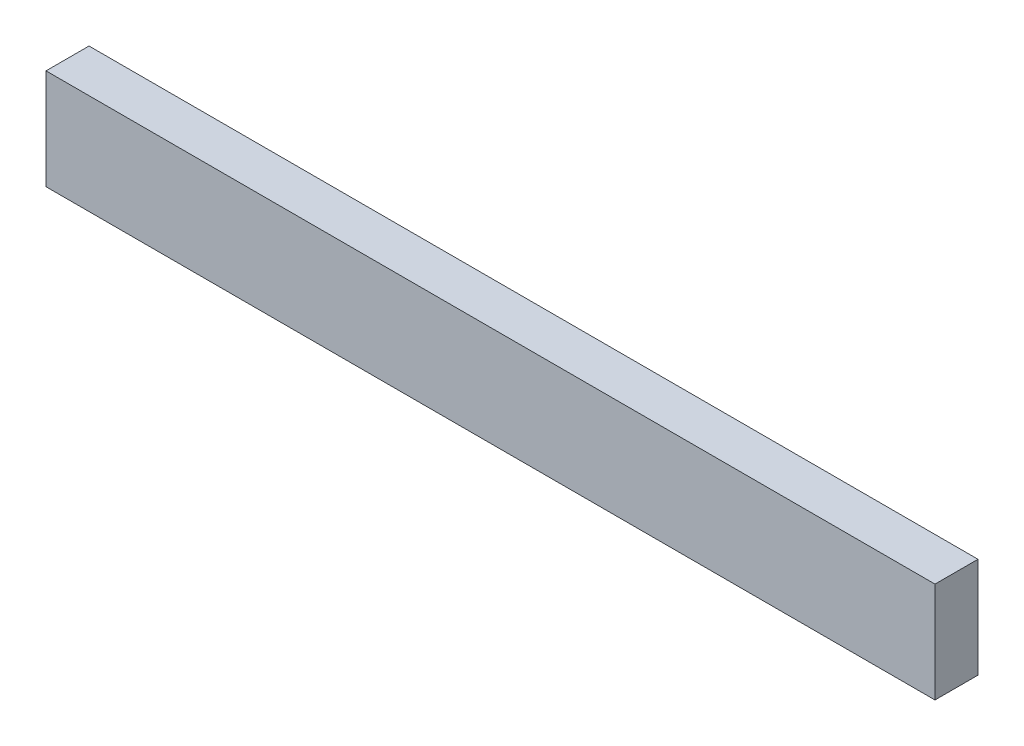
from build123d import *

# Parameters (mm, degrees)
SKETCH1_W           = 38.1
SKETCH1_H           = 88.9
BOSS_EXTRUDE1_DEPTH = 787.4


with BuildPart() as part:
    # Sketch1 → Boss-Extrude1 (new body)
    with BuildSketch(Plane(origin=(0, 0, 0), x_dir=(0, 0, -1), z_dir=(1, 0, 0))):
        Rectangle(SKETCH1_W, SKETCH1_H)
    extrude(amount=BOSS_EXTRUDE1_DEPTH)


solid = part.part
